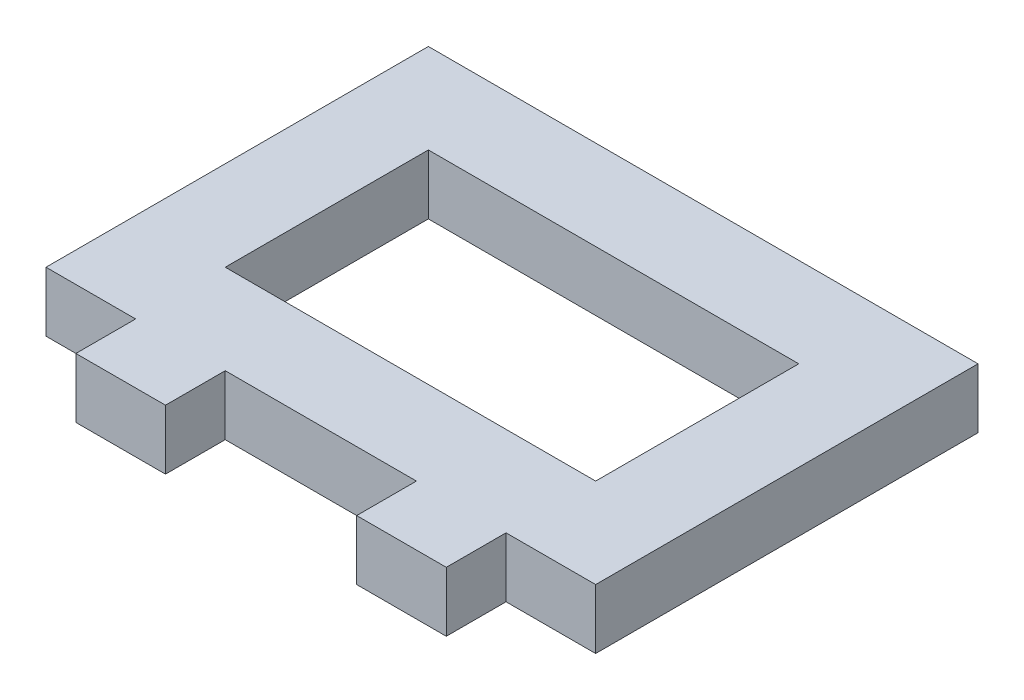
from build123d import *

# Parameters (mm, degrees)
SKETCH1_W           = 31
SKETCH1_H           = 17
BOSS_EXTRUDE1_DEPTH = 5


with BuildPart() as part:
    # Sketch1 → Boss-Extrude1 (new body)
    with BuildSketch(Plane(origin=(0, 0, 0), x_dir=(1, 0, 0), z_dir=(0, 1, 0))):
        Polygon((0, 0), (46, 0), (46, -32), (38.5, -32), (38.5, -37), (31, -37), (31, -32), (15, -32), (15, -37), (7.5, -37), (7.5, -32), (0, -32), align=None)
        with Locations((23, -16)):
            Rectangle(SKETCH1_W, SKETCH1_H, mode=Mode.SUBTRACT)
    extrude(amount=BOSS_EXTRUDE1_DEPTH)


solid = part.part
